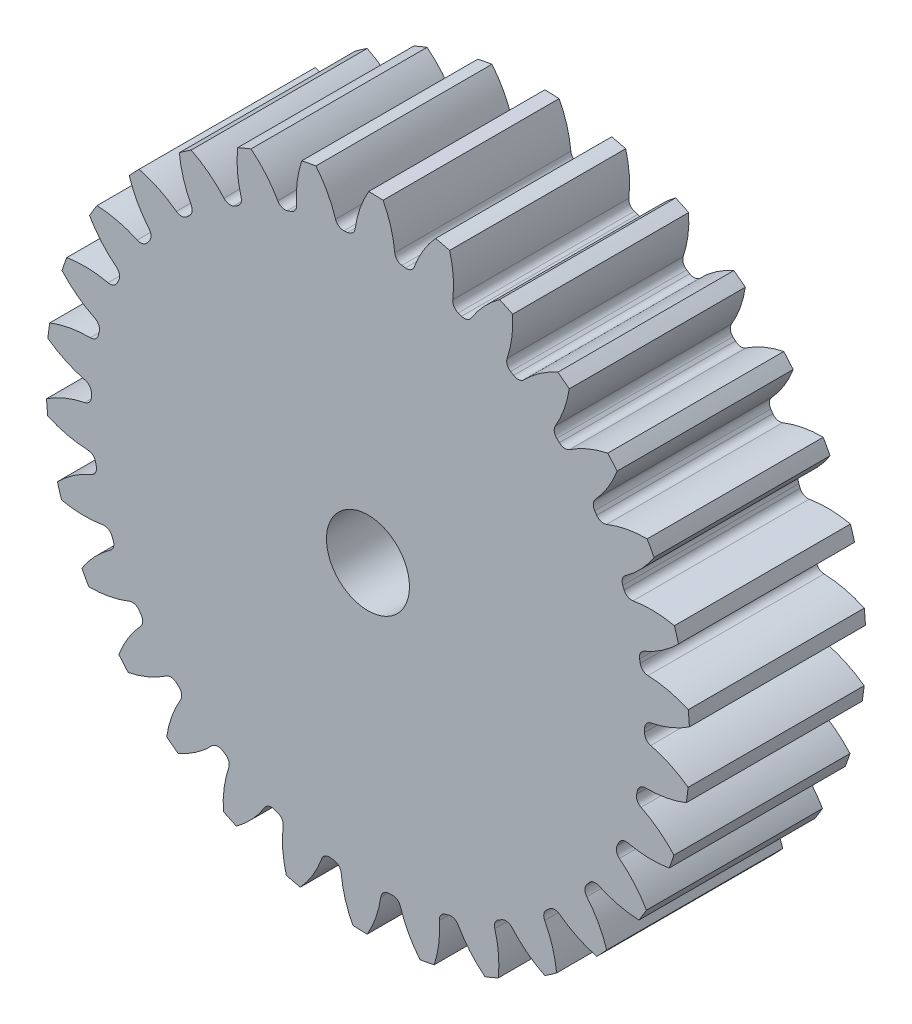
from build123d import *

# Parameters (mm, degrees)
SKETCH3_R         = 162.56
GEARBODY_DEPTH    = 88.9
TOOTHCUT_DEPTH    = 247.484720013
CIRPATTERN1_COUNT = 30
BOREDIA_R         = 20.955
BORE_DEPTH        = 12700


with BuildPart() as part:
    # Sketch3 → gearBody (new body)
    with BuildSketch(Plane.XY):
        Circle(SKETCH3_R)
    extrude(amount=GEARBODY_DEPTH)

    # Sketch2 → toothCut (cut, through all)
    with BuildSketch(Plane.XY):
        with BuildLine():
            ThreePointArc((139.63245527, -4.343666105), (139.657515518, -3.44504853), (139.676792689, -2.546288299))
            ThreePointArc((139.676792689, -2.546288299), (140.636986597, 0.02851575), (142.999031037, 1.432913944))
            ThreePointArc((142.999031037, 1.432913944), (153.178313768, 4.532738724), (162.56, 9.553761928))
            ThreePointArc((162.56, 9.553761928), (162.790976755, -4.015700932), (161.89122951, -17.557271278))
            ThreePointArc((161.89122951, -17.557271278), (152.768518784, -12.079784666), (142.754455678, -8.481833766))
            ThreePointArc((142.754455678, -8.481833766), (140.464528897, -6.962681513), (139.63245527, -4.343666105))
        make_face()
    toothcut = extrude(amount=TOOTHCUT_DEPTH, mode=Mode.SUBTRACT)

    # CirPattern1: toothCut ×30 about axis
    cirpattern1_axis = Axis((0, 0, 0), (0, 0, 1))
    for i in range(1, CIRPATTERN1_COUNT):
        add(toothcut.rotate(cirpattern1_axis, i * 360 / CIRPATTERN1_COUNT), mode=Mode.SUBTRACT)

    # boreDia → bore (cut, symmetric)
    with BuildSketch(Plane.XY):
        Circle(BOREDIA_R)
    extrude(amount=BORE_DEPTH, both=True, mode=Mode.SUBTRACT)


solid = part.part
